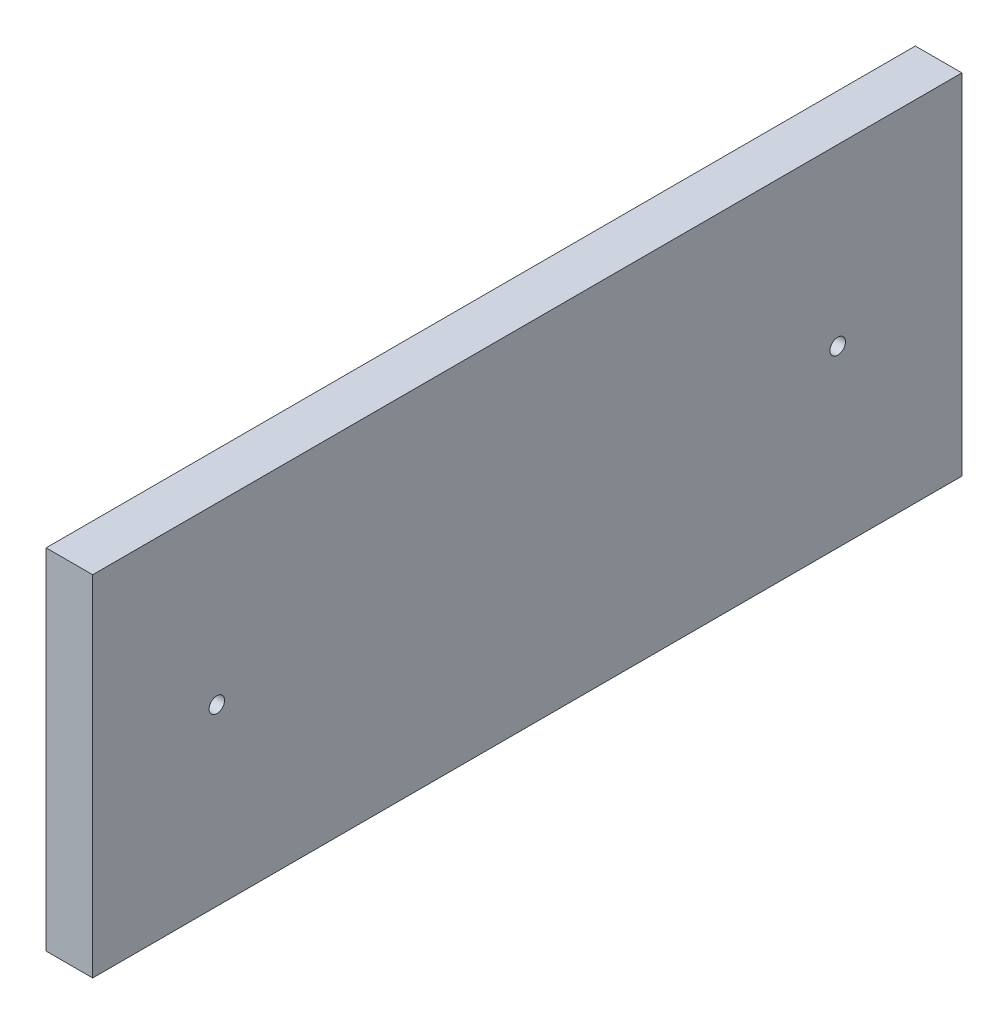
ISO-10303-21;
HEADER;
FILE_DESCRIPTION(('STEP AP214'),'2;1');
FILE_NAME('part.step','',(''),(''),'','','');
FILE_SCHEMA(('AUTOMOTIVE_DESIGN { 1 0 10303 214 1 1 1 1 }'));
ENDSEC;
DATA;
#1=APPLICATION_CONTEXT('core data for automotive mechanical design processes');
#2=APPLICATION_PROTOCOL_DEFINITION('international standard','automotive_design',2000,#1);
#3=PRODUCT_CONTEXT('',#1,'mechanical');
#4=PRODUCT('Part','Part','',(#3));
#5=PRODUCT_RELATED_PRODUCT_CATEGORY('part','',(#4));
#6=PRODUCT_DEFINITION_FORMATION('','',#4);
#7=PRODUCT_DEFINITION_CONTEXT('part definition',#1,'design');
#8=PRODUCT_DEFINITION('design','',#6,#7);
#9=PRODUCT_DEFINITION_SHAPE('','',#8);
#10=(LENGTH_UNIT() NAMED_UNIT(*) SI_UNIT(.MILLI.,.METRE.));
#11=(NAMED_UNIT(*) PLANE_ANGLE_UNIT() SI_UNIT($,.RADIAN.));
#12=(NAMED_UNIT(*) SI_UNIT($,.STERADIAN.) SOLID_ANGLE_UNIT());
#13=UNCERTAINTY_MEASURE_WITH_UNIT(LENGTH_MEASURE(1.E-05),#10,'distance_accuracy_value','');
#14=(GEOMETRIC_REPRESENTATION_CONTEXT(3) GLOBAL_UNCERTAINTY_ASSIGNED_CONTEXT((#13)) GLOBAL_UNIT_ASSIGNED_CONTEXT((#10,
#11,#12)) REPRESENTATION_CONTEXT('',''));
#15=CARTESIAN_POINT('',(0.,0.,0.));
#16=DIRECTION('',(0.,0.,1.));
#17=DIRECTION('',(1.,0.,0.));
#18=AXIS2_PLACEMENT_3D('',#15,#16,#17);
#19=CARTESIAN_POINT('',(0.,0.,711.2));
#20=DIRECTION('',(1.,0.,0.));
#21=DIRECTION('',(0.,0.,-1.));
#22=AXIS2_PLACEMENT_3D('',#19,#20,#21);
#23=PLANE('',#22);
#24=CARTESIAN_POINT('',(0.,142.875,609.6));
#25=DIRECTION('',(1.,0.,0.));
#26=DIRECTION('',(0.,0.,-1.));
#27=AXIS2_PLACEMENT_3D('',#24,#25,#26);
#28=CIRCLE('',#27,6.34999999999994);
#29=CARTESIAN_POINT('',(0.,142.875,603.25));
#30=VERTEX_POINT('',#29);
#31=EDGE_CURVE('E105',#30,#30,#28,.T.);
#32=ORIENTED_EDGE('',*,*,#31,.T.);
#33=EDGE_LOOP('',(#32));
#34=FACE_BOUND('',#33,.T.);
#35=CARTESIAN_POINT('',(0.,142.875,101.6));
#36=DIRECTION('',(1.,0.,0.));
#37=DIRECTION('',(0.,0.,-1.));
#38=AXIS2_PLACEMENT_3D('',#35,#36,#37);
#39=CIRCLE('',#38,6.34999999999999);
#40=CARTESIAN_POINT('',(0.,142.875,95.2500000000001));
#41=VERTEX_POINT('',#40);
#42=EDGE_CURVE('E116',#41,#41,#39,.T.);
#43=ORIENTED_EDGE('',*,*,#42,.T.);
#44=EDGE_LOOP('',(#43));
#45=FACE_BOUND('',#44,.T.);
#46=DIRECTION('',(0.,-1.,0.));
#47=VECTOR('',#46,1.);
#48=CARTESIAN_POINT('',(0.,0.,0.));
#49=LINE('',#48,#47);
#50=CARTESIAN_POINT('',(0.,285.75,0.));
#51=VERTEX_POINT('',#50);
#52=CARTESIAN_POINT('',(0.,0.,0.));
#53=VERTEX_POINT('',#52);
#54=EDGE_CURVE('E102',#51,#53,#49,.T.);
#55=ORIENTED_EDGE('',*,*,#54,.T.);
#56=DIRECTION('',(0.,0.,-1.));
#57=VECTOR('',#56,1.);
#58=CARTESIAN_POINT('',(0.,0.,711.2));
#59=LINE('',#58,#57);
#60=CARTESIAN_POINT('',(0.,0.,711.2));
#61=VERTEX_POINT('',#60);
#62=EDGE_CURVE('E11',#61,#53,#59,.T.);
#63=ORIENTED_EDGE('',*,*,#62,.F.);
#64=DIRECTION('',(0.,-1.,0.));
#65=VECTOR('',#64,1.);
#66=CARTESIAN_POINT('',(0.,0.,711.2));
#67=LINE('',#66,#65);
#68=CARTESIAN_POINT('',(0.,285.75,711.2));
#69=VERTEX_POINT('',#68);
#70=EDGE_CURVE('E90',#69,#61,#67,.T.);
#71=ORIENTED_EDGE('',*,*,#70,.F.);
#72=DIRECTION('',(0.,0.,-1.));
#73=VECTOR('',#72,1.);
#74=CARTESIAN_POINT('',(0.,285.75,711.2));
#75=LINE('',#74,#73);
#76=EDGE_CURVE('E98',#69,#51,#75,.T.);
#77=ORIENTED_EDGE('',*,*,#76,.T.);
#78=EDGE_LOOP('',(#55,#63,#71,#77));
#79=FACE_BOUND('',#78,.T.);
#80=ADVANCED_FACE('F39',(#34,#45,#79),#23,.F.);
#81=CARTESIAN_POINT('',(0.,0.,711.2));
#82=DIRECTION('',(0.,1.,0.));
#83=DIRECTION('',(0.,0.,1.));
#84=AXIS2_PLACEMENT_3D('',#81,#82,#83);
#85=PLANE('',#84);
#86=DIRECTION('',(1.,0.,0.));
#87=VECTOR('',#86,1.);
#88=CARTESIAN_POINT('',(0.,0.,0.));
#89=LINE('',#88,#87);
#90=CARTESIAN_POINT('',(38.1,0.,0.));
#91=VERTEX_POINT('',#90);
#92=EDGE_CURVE('E94',#53,#91,#89,.T.);
#93=ORIENTED_EDGE('',*,*,#92,.T.);
#94=DIRECTION('',(0.,0.,-1.));
#95=VECTOR('',#94,1.);
#96=CARTESIAN_POINT('',(38.1,0.,711.2));
#97=LINE('',#96,#95);
#98=CARTESIAN_POINT('',(38.1,0.,711.2));
#99=VERTEX_POINT('',#98);
#100=EDGE_CURVE('E47',#99,#91,#97,.T.);
#101=ORIENTED_EDGE('',*,*,#100,.F.);
#102=DIRECTION('',(1.,0.,0.));
#103=VECTOR('',#102,1.);
#104=CARTESIAN_POINT('',(0.,0.,711.2));
#105=LINE('',#104,#103);
#106=EDGE_CURVE('E85',#61,#99,#105,.T.);
#107=ORIENTED_EDGE('',*,*,#106,.F.);
#108=ORIENTED_EDGE('',*,*,#62,.T.);
#109=EDGE_LOOP('',(#93,#101,#107,#108));
#110=FACE_BOUND('',#109,.T.);
#111=ADVANCED_FACE('F93',(#110),#85,.F.);
#112=CARTESIAN_POINT('',(38.1,0.,711.2));
#113=DIRECTION('',(-1.,0.,0.));
#114=DIRECTION('',(0.,-1.,0.));
#115=AXIS2_PLACEMENT_3D('',#112,#113,#114);
#116=PLANE('',#115);
#117=CARTESIAN_POINT('',(38.1,142.875,609.6));
#118=DIRECTION('',(1.,0.,0.));
#119=DIRECTION('',(0.,0.,-1.));
#120=AXIS2_PLACEMENT_3D('',#117,#118,#119);
#121=CIRCLE('',#120,6.34999999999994);
#122=CARTESIAN_POINT('',(38.1,142.875,603.25));
#123=VERTEX_POINT('',#122);
#124=EDGE_CURVE('E122',#123,#123,#121,.T.);
#125=ORIENTED_EDGE('',*,*,#124,.F.);
#126=EDGE_LOOP('',(#125));
#127=FACE_BOUND('',#126,.T.);
#128=CARTESIAN_POINT('',(38.1,142.875,101.6));
#129=DIRECTION('',(1.,0.,0.));
#130=DIRECTION('',(0.,0.,-1.));
#131=AXIS2_PLACEMENT_3D('',#128,#129,#130);
#132=CIRCLE('',#131,6.34999999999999);
#133=CARTESIAN_POINT('',(38.1,142.875,95.2500000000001));
#134=VERTEX_POINT('',#133);
#135=EDGE_CURVE('E119',#134,#134,#132,.T.);
#136=ORIENTED_EDGE('',*,*,#135,.F.);
#137=EDGE_LOOP('',(#136));
#138=FACE_BOUND('',#137,.T.);
#139=DIRECTION('',(0.,1.,0.));
#140=VECTOR('',#139,1.);
#141=CARTESIAN_POINT('',(38.1,0.,0.));
#142=LINE('',#141,#140);
#143=CARTESIAN_POINT('',(38.1,285.75,0.));
#144=VERTEX_POINT('',#143);
#145=EDGE_CURVE('E72',#91,#144,#142,.T.);
#146=ORIENTED_EDGE('',*,*,#145,.T.);
#147=DIRECTION('',(0.,0.,-1.));
#148=VECTOR('',#147,1.);
#149=CARTESIAN_POINT('',(38.1,285.75,711.2));
#150=LINE('',#149,#148);
#151=CARTESIAN_POINT('',(38.1,285.75,711.2));
#152=VERTEX_POINT('',#151);
#153=EDGE_CURVE('E95',#152,#144,#150,.T.);
#154=ORIENTED_EDGE('',*,*,#153,.F.);
#155=DIRECTION('',(0.,1.,0.));
#156=VECTOR('',#155,1.);
#157=CARTESIAN_POINT('',(38.1,0.,711.2));
#158=LINE('',#157,#156);
#159=EDGE_CURVE('E88',#99,#152,#158,.T.);
#160=ORIENTED_EDGE('',*,*,#159,.F.);
#161=ORIENTED_EDGE('',*,*,#100,.T.);
#162=EDGE_LOOP('',(#146,#154,#160,#161));
#163=FACE_BOUND('',#162,.T.);
#164=ADVANCED_FACE('F96',(#127,#138,#163),#116,.F.);
#165=CARTESIAN_POINT('',(0.,285.75,711.2));
#166=DIRECTION('',(0.,-1.,0.));
#167=DIRECTION('',(0.,0.,-1.));
#168=AXIS2_PLACEMENT_3D('',#165,#166,#167);
#169=PLANE('',#168);
#170=DIRECTION('',(-1.,0.,0.));
#171=VECTOR('',#170,1.);
#172=CARTESIAN_POINT('',(0.,285.75,0.));
#173=LINE('',#172,#171);
#174=EDGE_CURVE('E78',#144,#51,#173,.T.);
#175=ORIENTED_EDGE('',*,*,#174,.T.);
#176=ORIENTED_EDGE('',*,*,#76,.F.);
#177=DIRECTION('',(-1.,0.,0.));
#178=VECTOR('',#177,1.);
#179=CARTESIAN_POINT('',(0.,285.75,711.2));
#180=LINE('',#179,#178);
#181=EDGE_CURVE('E55',#152,#69,#180,.T.);
#182=ORIENTED_EDGE('',*,*,#181,.F.);
#183=ORIENTED_EDGE('',*,*,#153,.T.);
#184=EDGE_LOOP('',(#175,#176,#182,#183));
#185=FACE_BOUND('',#184,.T.);
#186=ADVANCED_FACE('F110',(#185),#169,.F.);
#187=CARTESIAN_POINT('',(0.,0.,711.2));
#188=DIRECTION('',(0.,0.,-1.));
#189=DIRECTION('',(-1.,0.,0.));
#190=AXIS2_PLACEMENT_3D('',#187,#188,#189);
#191=PLANE('',#190);
#192=ORIENTED_EDGE('',*,*,#70,.T.);
#193=ORIENTED_EDGE('',*,*,#106,.T.);
#194=ORIENTED_EDGE('',*,*,#159,.T.);
#195=ORIENTED_EDGE('',*,*,#181,.T.);
#196=EDGE_LOOP('',(#192,#193,#194,#195));
#197=FACE_BOUND('',#196,.T.);
#198=ADVANCED_FACE('F86',(#197),#191,.F.);
#199=CARTESIAN_POINT('',(0.,0.,0.));
#200=DIRECTION('',(0.,0.,-1.));
#201=DIRECTION('',(-1.,0.,0.));
#202=AXIS2_PLACEMENT_3D('',#199,#200,#201);
#203=PLANE('',#202);
#204=ORIENTED_EDGE('',*,*,#54,.F.);
#205=ORIENTED_EDGE('',*,*,#174,.F.);
#206=ORIENTED_EDGE('',*,*,#145,.F.);
#207=ORIENTED_EDGE('',*,*,#92,.F.);
#208=EDGE_LOOP('',(#204,#205,#206,#207));
#209=FACE_BOUND('',#208,.T.);
#210=ADVANCED_FACE('F113',(#209),#203,.T.);
#211=CARTESIAN_POINT('',(0.,142.875,101.6));
#212=DIRECTION('',(1.,0.,0.));
#213=DIRECTION('',(0.,0.,-1.));
#214=AXIS2_PLACEMENT_3D('',#211,#212,#213);
#215=CYLINDRICAL_SURFACE('',#214,6.34999999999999);
#216=ORIENTED_EDGE('',*,*,#42,.F.);
#217=EDGE_LOOP('',(#216));
#218=FACE_BOUND('',#217,.T.);
#219=ORIENTED_EDGE('',*,*,#135,.T.);
#220=EDGE_LOOP('',(#219));
#221=FACE_BOUND('',#220,.T.);
#222=ADVANCED_FACE('F133',(#218,#221),#215,.F.);
#223=CARTESIAN_POINT('',(0.,142.875,609.6));
#224=DIRECTION('',(1.,0.,0.));
#225=DIRECTION('',(0.,0.,-1.));
#226=AXIS2_PLACEMENT_3D('',#223,#224,#225);
#227=CYLINDRICAL_SURFACE('',#226,6.34999999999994);
#228=ORIENTED_EDGE('',*,*,#31,.F.);
#229=EDGE_LOOP('',(#228));
#230=FACE_BOUND('',#229,.T.);
#231=ORIENTED_EDGE('',*,*,#124,.T.);
#232=EDGE_LOOP('',(#231));
#233=FACE_BOUND('',#232,.T.);
#234=ADVANCED_FACE('F130',(#230,#233),#227,.F.);
#235=CLOSED_SHELL('',(#80,#111,#164,#186,#198,#210,#222,#234));
#236=MANIFOLD_SOLID_BREP('B2',#235);
#237=ADVANCED_BREP_SHAPE_REPRESENTATION('',(#18,#236),#14);
#238=SHAPE_DEFINITION_REPRESENTATION(#9,#237);
ENDSEC;
END-ISO-10303-21;
